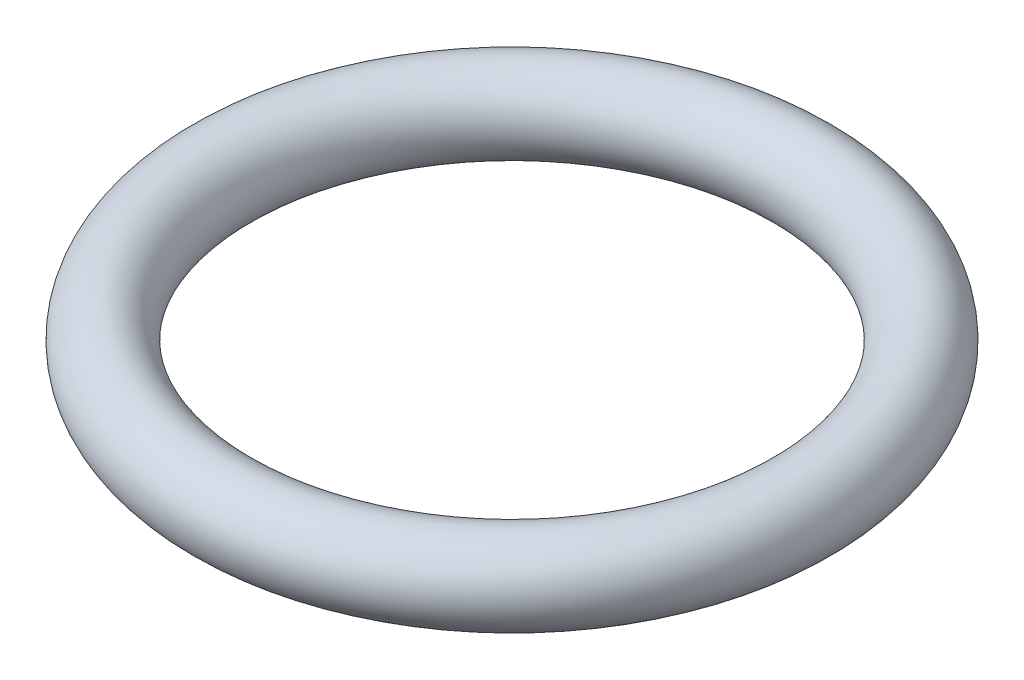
from build123d import *

# Parameters (mm, degrees)
ESQUISSE1_R = 0.732050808


with BuildPart() as part:
    # Esquisse1 → R_volution1 (revolve)
    with BuildSketch(Plane.XY, mode=Mode.PRIVATE) as r_volution1_sk:
        with Locations((-1.3789205, 25.218991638)):
            Circle(ESQUISSE1_R)
    revolve(r_volution1_sk.sketch.rotate(Axis((3.889028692, 31.274874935, 0), (0, -1, 0)), 270), axis=Axis((3.889028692, 31.274874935, 0), (0, -1, 0)))


solid = part.part
